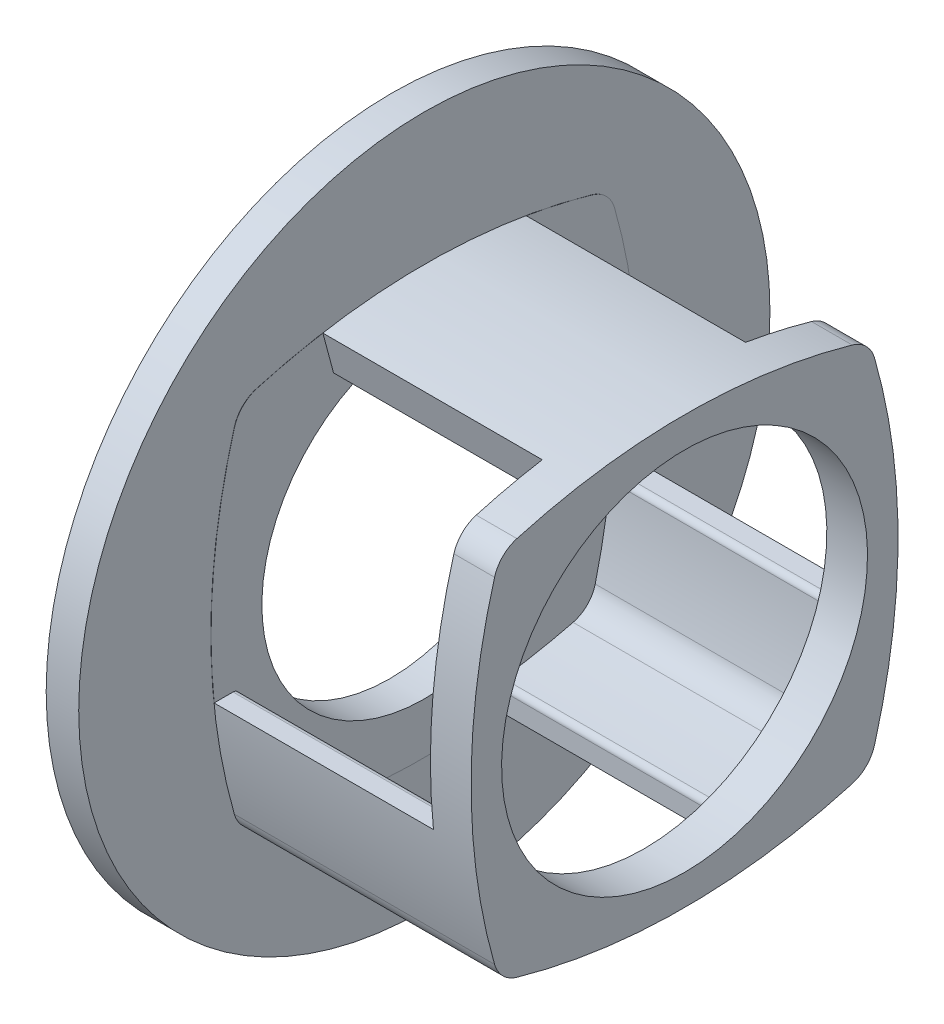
ISO-10303-21;
HEADER;
FILE_DESCRIPTION(('STEP AP214'),'2;1');
FILE_NAME('part.step','',(''),(''),'','','');
FILE_SCHEMA(('AUTOMOTIVE_DESIGN { 1 0 10303 214 1 1 1 1 }'));
ENDSEC;
DATA;
#1=APPLICATION_CONTEXT('core data for automotive mechanical design processes');
#2=APPLICATION_PROTOCOL_DEFINITION('international standard','automotive_design',2000,#1);
#3=PRODUCT_CONTEXT('',#1,'mechanical');
#4=PRODUCT('Part','Part','',(#3));
#5=PRODUCT_RELATED_PRODUCT_CATEGORY('part','',(#4));
#6=PRODUCT_DEFINITION_FORMATION('','',#4);
#7=PRODUCT_DEFINITION_CONTEXT('part definition',#1,'design');
#8=PRODUCT_DEFINITION('design','',#6,#7);
#9=PRODUCT_DEFINITION_SHAPE('','',#8);
#10=(LENGTH_UNIT() NAMED_UNIT(*) SI_UNIT(.MILLI.,.METRE.));
#11=(NAMED_UNIT(*) PLANE_ANGLE_UNIT() SI_UNIT($,.RADIAN.));
#12=(NAMED_UNIT(*) SI_UNIT($,.STERADIAN.) SOLID_ANGLE_UNIT());
#13=UNCERTAINTY_MEASURE_WITH_UNIT(LENGTH_MEASURE(1.E-05),#10,'distance_accuracy_value','');
#14=(GEOMETRIC_REPRESENTATION_CONTEXT(3) GLOBAL_UNCERTAINTY_ASSIGNED_CONTEXT((#13)) GLOBAL_UNIT_ASSIGNED_CONTEXT((#10,
#11,#12)) REPRESENTATION_CONTEXT('',''));
#15=CARTESIAN_POINT('',(0.,0.,0.));
#16=DIRECTION('',(0.,0.,1.));
#17=DIRECTION('',(1.,0.,0.));
#18=AXIS2_PLACEMENT_3D('',#15,#16,#17);
#19=CARTESIAN_POINT('',(153.35,0.,0.));
#20=DIRECTION('',(-1.,0.,0.));
#21=DIRECTION('',(0.,-1.,0.));
#22=AXIS2_PLACEMENT_3D('',#19,#20,#21);
#23=CYLINDRICAL_SURFACE('',#22,90.);
#24=CARTESIAN_POINT('',(125.,0.,0.));
#25=DIRECTION('',(-1.,0.,0.));
#26=DIRECTION('',(0.,-1.,0.));
#27=AXIS2_PLACEMENT_3D('',#24,#25,#26);
#28=CIRCLE('',#27,90.);
#29=CARTESIAN_POINT('',(125.,-90.,0.));
#30=VERTEX_POINT('',#29);
#31=EDGE_CURVE('E507',#30,#30,#28,.T.);
#32=ORIENTED_EDGE('',*,*,#31,.T.);
#33=EDGE_LOOP('',(#32));
#34=FACE_BOUND('',#33,.T.);
#35=CARTESIAN_POINT('',(145.,0.,0.));
#36=DIRECTION('',(-1.,0.,0.));
#37=DIRECTION('',(0.,-1.,0.));
#38=AXIS2_PLACEMENT_3D('',#35,#36,#37);
#39=CIRCLE('',#38,90.);
#40=CARTESIAN_POINT('',(145.,-90.,0.));
#41=VERTEX_POINT('',#40);
#42=EDGE_CURVE('E519',#41,#41,#39,.T.);
#43=ORIENTED_EDGE('',*,*,#42,.F.);
#44=EDGE_LOOP('',(#43));
#45=FACE_BOUND('',#44,.T.);
#46=ADVANCED_FACE('F17',(#34,#45),#23,.F.);
#47=CARTESIAN_POINT('',(17.,78.0612428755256,-78.0612428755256));
#48=DIRECTION('',(1.,0.,0.));
#49=DIRECTION('',(0.,0.,-1.));
#50=AXIS2_PLACEMENT_3D('',#47,#48,#49);
#51=CYLINDRICAL_SURFACE('',#50,16.0000000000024);
#52=DIRECTION('',(1.,0.,0.));
#53=VECTOR('',#52,1.);
#54=CARTESIAN_POINT('',(17.,82.4590593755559,-93.4449748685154));
#55=LINE('',#54,#53);
#56=CARTESIAN_POINT('',(125.,82.4590593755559,-93.4449748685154));
#57=VERTEX_POINT('',#56);
#58=CARTESIAN_POINT('',(145.,82.4590593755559,-93.4449748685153));
#59=VERTEX_POINT('',#58);
#60=EDGE_CURVE('E333',#57,#59,#55,.T.);
#61=ORIENTED_EDGE('',*,*,#60,.F.);
#62=CARTESIAN_POINT('',(125.,78.0612428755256,-78.0612428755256));
#63=DIRECTION('',(1.,0.,0.));
#64=DIRECTION('',(0.,0.,-1.));
#65=AXIS2_PLACEMENT_3D('',#62,#63,#64);
#66=CIRCLE('',#65,16.0000000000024);
#67=CARTESIAN_POINT('',(125.,93.4449748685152,-82.4590593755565));
#68=VERTEX_POINT('',#67);
#69=EDGE_CURVE('E512',#57,#68,#66,.T.);
#70=ORIENTED_EDGE('',*,*,#69,.T.);
#71=DIRECTION('',(1.,0.,0.));
#72=VECTOR('',#71,1.);
#73=CARTESIAN_POINT('',(17.,93.444974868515,-82.459059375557));
#74=LINE('',#73,#72);
#75=CARTESIAN_POINT('',(145.,93.4449748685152,-82.4590593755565));
#76=VERTEX_POINT('',#75);
#77=EDGE_CURVE('E309',#76,#68,#74,.F.);
#78=ORIENTED_EDGE('',*,*,#77,.F.);
#79=CARTESIAN_POINT('',(145.,78.0612428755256,-78.0612428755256));
#80=DIRECTION('',(1.,0.,0.));
#81=DIRECTION('',(0.,0.,-1.));
#82=AXIS2_PLACEMENT_3D('',#79,#80,#81);
#83=CIRCLE('',#82,16.0000000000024);
#84=EDGE_CURVE('E269',#59,#76,#83,.T.);
#85=ORIENTED_EDGE('',*,*,#84,.F.);
#86=EDGE_LOOP('',(#61,#70,#78,#85));
#87=FACE_BOUND('',#86,.T.);
#88=ADVANCED_FACE('F527',(#87),#51,.T.);
#89=CARTESIAN_POINT('',(17.,78.0612428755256,78.0612428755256));
#90=DIRECTION('',(1.,0.,0.));
#91=DIRECTION('',(0.,0.,-1.));
#92=AXIS2_PLACEMENT_3D('',#89,#90,#91);
#93=CYLINDRICAL_SURFACE('',#92,16.0000000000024);
#94=DIRECTION('',(1.,0.,0.));
#95=VECTOR('',#94,1.);
#96=CARTESIAN_POINT('',(17.,93.4449748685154,82.4590593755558));
#97=LINE('',#96,#95);
#98=CARTESIAN_POINT('',(125.,93.4449748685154,82.4590593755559));
#99=VERTEX_POINT('',#98);
#100=CARTESIAN_POINT('',(145.,93.4449748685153,82.4590593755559));
#101=VERTEX_POINT('',#100);
#102=EDGE_CURVE('E314',#99,#101,#97,.T.);
#103=ORIENTED_EDGE('',*,*,#102,.F.);
#104=CARTESIAN_POINT('',(125.,78.0612428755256,78.0612428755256));
#105=DIRECTION('',(1.,0.,0.));
#106=DIRECTION('',(0.,0.,-1.));
#107=AXIS2_PLACEMENT_3D('',#104,#105,#106);
#108=CIRCLE('',#107,16.0000000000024);
#109=CARTESIAN_POINT('',(125.,82.4590593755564,93.4449748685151));
#110=VERTEX_POINT('',#109);
#111=EDGE_CURVE('E510',#99,#110,#108,.T.);
#112=ORIENTED_EDGE('',*,*,#111,.T.);
#113=DIRECTION('',(1.,0.,0.));
#114=VECTOR('',#113,1.);
#115=CARTESIAN_POINT('',(17.,82.459059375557,93.444974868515));
#116=LINE('',#115,#114);
#117=CARTESIAN_POINT('',(145.,82.4590593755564,93.4449748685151));
#118=VERTEX_POINT('',#117);
#119=EDGE_CURVE('E296',#118,#110,#116,.F.);
#120=ORIENTED_EDGE('',*,*,#119,.F.);
#121=CARTESIAN_POINT('',(145.,78.0612428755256,78.0612428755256));
#122=DIRECTION('',(1.,0.,0.));
#123=DIRECTION('',(0.,0.,-1.));
#124=AXIS2_PLACEMENT_3D('',#121,#122,#123);
#125=CIRCLE('',#124,16.0000000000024);
#126=EDGE_CURVE('E522',#101,#118,#125,.T.);
#127=ORIENTED_EDGE('',*,*,#126,.F.);
#128=EDGE_LOOP('',(#103,#112,#120,#127));
#129=FACE_BOUND('',#128,.T.);
#130=ADVANCED_FACE('F535',(#129),#93,.T.);
#131=CARTESIAN_POINT('',(17.,-78.0612428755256,-78.0612428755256));
#132=DIRECTION('',(1.,0.,0.));
#133=DIRECTION('',(0.,0.,-1.));
#134=AXIS2_PLACEMENT_3D('',#131,#132,#133);
#135=CYLINDRICAL_SURFACE('',#134,16.0000000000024);
#136=DIRECTION('',(1.,0.,0.));
#137=VECTOR('',#136,1.);
#138=CARTESIAN_POINT('',(17.,-93.4449748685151,-82.4590593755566));
#139=LINE('',#138,#137);
#140=CARTESIAN_POINT('',(17.,-93.4449748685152,-82.4590593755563));
#141=VERTEX_POINT('',#140);
#142=CARTESIAN_POINT('',(145.,-93.4449748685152,-82.4590593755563));
#143=VERTEX_POINT('',#142);
#144=EDGE_CURVE('E262',#141,#143,#139,.T.);
#145=ORIENTED_EDGE('',*,*,#144,.F.);
#146=CARTESIAN_POINT('',(17.,-78.0612428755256,-78.0612428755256));
#147=DIRECTION('',(1.,0.,0.));
#148=DIRECTION('',(0.,0.,-1.));
#149=AXIS2_PLACEMENT_3D('',#146,#147,#148);
#150=CIRCLE('',#149,16.0000000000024);
#151=CARTESIAN_POINT('',(17.,-82.4590593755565,-93.4449748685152));
#152=VERTEX_POINT('',#151);
#153=EDGE_CURVE('E516',#141,#152,#150,.T.);
#154=ORIENTED_EDGE('',*,*,#153,.T.);
#155=DIRECTION('',(1.,0.,0.));
#156=VECTOR('',#155,1.);
#157=CARTESIAN_POINT('',(17.,-82.459059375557,-93.444974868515));
#158=LINE('',#157,#156);
#159=CARTESIAN_POINT('',(145.,-82.4590593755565,-93.4449748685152));
#160=VERTEX_POINT('',#159);
#161=EDGE_CURVE('E265',#160,#152,#158,.F.);
#162=ORIENTED_EDGE('',*,*,#161,.F.);
#163=CARTESIAN_POINT('',(145.,-78.0612428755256,-78.0612428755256));
#164=DIRECTION('',(1.,0.,0.));
#165=DIRECTION('',(0.,0.,-1.));
#166=AXIS2_PLACEMENT_3D('',#163,#164,#165);
#167=CIRCLE('',#166,16.0000000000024);
#168=EDGE_CURVE('E20',#143,#160,#167,.T.);
#169=ORIENTED_EDGE('',*,*,#168,.F.);
#170=EDGE_LOOP('',(#145,#154,#162,#169));
#171=FACE_BOUND('',#170,.T.);
#172=ADVANCED_FACE('F260',(#171),#135,.T.);
#173=CARTESIAN_POINT('',(145.,0.,0.));
#174=DIRECTION('',(1.,0.,0.));
#175=DIRECTION('',(0.,0.,-1.));
#176=AXIS2_PLACEMENT_3D('',#173,#174,#175);
#177=PLANE('',#176);
#178=ORIENTED_EDGE('',*,*,#42,.T.);
#179=EDGE_LOOP('',(#178));
#180=FACE_BOUND('',#179,.T.);
#181=CARTESIAN_POINT('',(145.,-78.0612428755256,78.0612428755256));
#182=DIRECTION('',(1.,0.,0.));
#183=DIRECTION('',(0.,0.,-1.));
#184=AXIS2_PLACEMENT_3D('',#181,#182,#183);
#185=CIRCLE('',#184,16.0000000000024);
#186=CARTESIAN_POINT('',(145.,-93.4449748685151,82.4590593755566));
#187=VERTEX_POINT('',#186);
#188=CARTESIAN_POINT('',(145.,-82.4590593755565,93.4449748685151));
#189=VERTEX_POINT('',#188);
#190=EDGE_CURVE('E274',#187,#189,#185,.F.);
#191=ORIENTED_EDGE('',*,*,#190,.F.);
#192=CARTESIAN_POINT('',(145.,194.999999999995,0.));
#193=DIRECTION('',(1.,0.,0.));
#194=DIRECTION('',(0.,0.,-1.));
#195=AXIS2_PLACEMENT_3D('',#192,#193,#194);
#196=CIRCLE('',#195,299.999999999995);
#197=EDGE_CURVE('E271',#143,#187,#196,.F.);
#198=ORIENTED_EDGE('',*,*,#197,.F.);
#199=ORIENTED_EDGE('',*,*,#168,.T.);
#200=CARTESIAN_POINT('',(145.,0.,194.999999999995));
#201=DIRECTION('',(1.,0.,0.));
#202=DIRECTION('',(0.,0.,-1.));
#203=AXIS2_PLACEMENT_3D('',#200,#201,#202);
#204=CIRCLE('',#203,299.999999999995);
#205=EDGE_CURVE('E332',#59,#160,#204,.F.);
#206=ORIENTED_EDGE('',*,*,#205,.F.);
#207=ORIENTED_EDGE('',*,*,#84,.T.);
#208=CARTESIAN_POINT('',(145.,-194.999999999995,0.));
#209=DIRECTION('',(1.,0.,0.));
#210=DIRECTION('',(0.,0.,-1.));
#211=AXIS2_PLACEMENT_3D('',#208,#209,#210);
#212=CIRCLE('',#211,299.999999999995);
#213=EDGE_CURVE('E313',#101,#76,#212,.F.);
#214=ORIENTED_EDGE('',*,*,#213,.F.);
#215=ORIENTED_EDGE('',*,*,#126,.T.);
#216=CARTESIAN_POINT('',(145.,0.,-194.999999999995));
#217=DIRECTION('',(1.,0.,0.));
#218=DIRECTION('',(0.,0.,-1.));
#219=AXIS2_PLACEMENT_3D('',#216,#217,#218);
#220=CIRCLE('',#219,299.999999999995);
#221=EDGE_CURVE('E300',#189,#118,#220,.F.);
#222=ORIENTED_EDGE('',*,*,#221,.F.);
#223=EDGE_LOOP('',(#191,#198,#199,#206,#207,#214,#215,#222));
#224=FACE_BOUND('',#223,.T.);
#225=ADVANCED_FACE('F272',(#180,#224),#177,.T.);
#226=CARTESIAN_POINT('',(17.,-78.0612428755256,78.0612428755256));
#227=DIRECTION('',(1.,0.,0.));
#228=DIRECTION('',(0.,0.,-1.));
#229=AXIS2_PLACEMENT_3D('',#226,#227,#228);
#230=CYLINDRICAL_SURFACE('',#229,16.0000000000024);
#231=DIRECTION('',(1.,0.,0.));
#232=VECTOR('',#231,1.);
#233=CARTESIAN_POINT('',(17.,-82.459059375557,93.444974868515));
#234=LINE('',#233,#232);
#235=CARTESIAN_POINT('',(17.,-82.4590593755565,93.4449748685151));
#236=VERTEX_POINT('',#235);
#237=EDGE_CURVE('E301',#236,#189,#234,.T.);
#238=ORIENTED_EDGE('',*,*,#237,.F.);
#239=CARTESIAN_POINT('',(17.,-78.0612428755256,78.0612428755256));
#240=DIRECTION('',(1.,0.,0.));
#241=DIRECTION('',(0.,0.,-1.));
#242=AXIS2_PLACEMENT_3D('',#239,#240,#241);
#243=CIRCLE('',#242,16.0000000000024);
#244=CARTESIAN_POINT('',(17.,-93.4449748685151,82.4590593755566));
#245=VERTEX_POINT('',#244);
#246=EDGE_CURVE('E514',#236,#245,#243,.T.);
#247=ORIENTED_EDGE('',*,*,#246,.T.);
#248=DIRECTION('',(1.,0.,0.));
#249=VECTOR('',#248,1.);
#250=CARTESIAN_POINT('',(17.,-93.4449748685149,82.4590593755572));
#251=LINE('',#250,#249);
#252=EDGE_CURVE('E278',#187,#245,#251,.F.);
#253=ORIENTED_EDGE('',*,*,#252,.F.);
#254=ORIENTED_EDGE('',*,*,#190,.T.);
#255=EDGE_LOOP('',(#238,#247,#253,#254));
#256=FACE_BOUND('',#255,.T.);
#257=ADVANCED_FACE('F544',(#256),#230,.T.);
#258=CARTESIAN_POINT('',(17.,0.,0.));
#259=DIRECTION('',(-1.,0.,0.));
#260=DIRECTION('',(0.,-1.,0.));
#261=AXIS2_PLACEMENT_3D('',#258,#259,#260);
#262=PLANE('',#261);
#263=CARTESIAN_POINT('',(17.,0.,-194.999999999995));
#264=DIRECTION('',(1.,0.,0.));
#265=DIRECTION('',(0.,0.,-1.));
#266=AXIS2_PLACEMENT_3D('',#263,#264,#265);
#267=CIRCLE('',#266,299.999999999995);
#268=CARTESIAN_POINT('',(17.,82.459059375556,93.4449748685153));
#269=VERTEX_POINT('',#268);
#270=EDGE_CURVE('E304',#269,#236,#267,.T.);
#271=ORIENTED_EDGE('',*,*,#270,.F.);
#272=CARTESIAN_POINT('',(17.,78.0612428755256,78.0612428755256));
#273=DIRECTION('',(1.,0.,0.));
#274=DIRECTION('',(0.,0.,-1.));
#275=AXIS2_PLACEMENT_3D('',#272,#273,#274);
#276=CIRCLE('',#275,16.0000000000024);
#277=CARTESIAN_POINT('',(17.,93.4449748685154,82.4590593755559));
#278=VERTEX_POINT('',#277);
#279=EDGE_CURVE('E453',#278,#269,#276,.T.);
#280=ORIENTED_EDGE('',*,*,#279,.F.);
#281=CARTESIAN_POINT('',(17.,-194.999999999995,0.));
#282=DIRECTION('',(1.,0.,0.));
#283=DIRECTION('',(0.,0.,-1.));
#284=AXIS2_PLACEMENT_3D('',#281,#282,#283);
#285=CIRCLE('',#284,299.999999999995);
#286=CARTESIAN_POINT('',(17.,93.4449748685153,-82.459059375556));
#287=VERTEX_POINT('',#286);
#288=EDGE_CURVE('E464',#287,#278,#285,.T.);
#289=ORIENTED_EDGE('',*,*,#288,.F.);
#290=CARTESIAN_POINT('',(17.,78.0612428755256,-78.0612428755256));
#291=DIRECTION('',(1.,0.,0.));
#292=DIRECTION('',(0.,0.,-1.));
#293=AXIS2_PLACEMENT_3D('',#290,#291,#292);
#294=CIRCLE('',#293,16.0000000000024);
#295=CARTESIAN_POINT('',(17.,82.4590593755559,-93.4449748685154));
#296=VERTEX_POINT('',#295);
#297=EDGE_CURVE('E308',#296,#287,#294,.T.);
#298=ORIENTED_EDGE('',*,*,#297,.F.);
#299=CARTESIAN_POINT('',(17.,0.,194.999999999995));
#300=DIRECTION('',(1.,0.,0.));
#301=DIRECTION('',(0.,0.,-1.));
#302=AXIS2_PLACEMENT_3D('',#299,#300,#301);
#303=CIRCLE('',#302,299.999999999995);
#304=EDGE_CURVE('E331',#152,#296,#303,.T.);
#305=ORIENTED_EDGE('',*,*,#304,.F.);
#306=ORIENTED_EDGE('',*,*,#153,.F.);
#307=CARTESIAN_POINT('',(17.,194.999999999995,0.));
#308=DIRECTION('',(1.,0.,0.));
#309=DIRECTION('',(0.,0.,-1.));
#310=AXIS2_PLACEMENT_3D('',#307,#308,#309);
#311=CIRCLE('',#310,299.999999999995);
#312=EDGE_CURVE('E283',#245,#141,#311,.T.);
#313=ORIENTED_EDGE('',*,*,#312,.F.);
#314=ORIENTED_EDGE('',*,*,#246,.F.);
#315=EDGE_LOOP('',(#271,#280,#289,#298,#305,#306,#313,#314));
#316=FACE_BOUND('',#315,.T.);
#317=CARTESIAN_POINT('',(17.,0.,0.));
#318=DIRECTION('',(-1.,0.,0.));
#319=DIRECTION('',(0.,-1.,0.));
#320=AXIS2_PLACEMENT_3D('',#317,#318,#319);
#321=CIRCLE('',#320,170.);
#322=CARTESIAN_POINT('',(17.,-170.,0.));
#323=VERTEX_POINT('',#322);
#324=EDGE_CURVE('E503',#323,#323,#321,.T.);
#325=ORIENTED_EDGE('',*,*,#324,.F.);
#326=EDGE_LOOP('',(#325));
#327=FACE_BOUND('',#326,.T.);
#328=ADVANCED_FACE('F546',(#316,#327),#262,.F.);
#329=CARTESIAN_POINT('',(125.,0.,0.));
#330=DIRECTION('',(1.,0.,0.));
#331=DIRECTION('',(0.,0.,-1.));
#332=AXIS2_PLACEMENT_3D('',#329,#330,#331);
#333=PLANE('',#332);
#334=ORIENTED_EDGE('',*,*,#31,.F.);
#335=EDGE_LOOP('',(#334));
#336=FACE_BOUND('',#335,.T.);
#337=CARTESIAN_POINT('',(125.,-93.4796166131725,38.9999999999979));
#338=DIRECTION('',(1.,0.,0.));
#339=DIRECTION('',(0.,0.,-1.));
#340=AXIS2_PLACEMENT_3D('',#337,#338,#339);
#341=CIRCLE('',#340,2.99999999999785);
#342=CARTESIAN_POINT('',(125.,-90.5045709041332,38.6138613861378));
#343=VERTEX_POINT('',#342);
#344=CARTESIAN_POINT('',(125.,-93.4796166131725,36.));
#345=VERTEX_POINT('',#344);
#346=EDGE_CURVE('E431',#343,#345,#341,.F.);
#347=ORIENTED_EDGE('',*,*,#346,.F.);
#348=CARTESIAN_POINT('',(125.,207.000000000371,-7.09624016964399E-11));
#349=DIRECTION('',(1.,0.,0.));
#350=DIRECTION('',(0.,0.,-1.));
#351=AXIS2_PLACEMENT_3D('',#348,#349,#350);
#352=CIRCLE('',#351,300.000000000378);
#353=CARTESIAN_POINT('',(125.,-83.9651447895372,73.0704079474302));
#354=VERTEX_POINT('',#353);
#355=EDGE_CURVE('E435',#343,#354,#352,.F.);
#356=ORIENTED_EDGE('',*,*,#355,.T.);
#357=CARTESIAN_POINT('',(125.,-69.4168875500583,69.4168875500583));
#358=DIRECTION('',(1.,0.,0.));
#359=DIRECTION('',(0.,0.,-1.));
#360=AXIS2_PLACEMENT_3D('',#357,#358,#359);
#361=CIRCLE('',#360,15.0000000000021);
#362=CARTESIAN_POINT('',(125.,-73.0704079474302,83.9651447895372));
#363=VERTEX_POINT('',#362);
#364=EDGE_CURVE('E439',#354,#363,#361,.F.);
#365=ORIENTED_EDGE('',*,*,#364,.T.);
#366=CARTESIAN_POINT('',(125.,2.90327761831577E-11,-207.000000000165));
#367=DIRECTION('',(1.,0.,0.));
#368=DIRECTION('',(0.,0.,-1.));
#369=AXIS2_PLACEMENT_3D('',#366,#367,#368);
#370=CIRCLE('',#369,300.000000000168);
#371=CARTESIAN_POINT('',(125.,-32.6732673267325,91.215455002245));
#372=VERTEX_POINT('',#371);
#373=EDGE_CURVE('E442',#363,#372,#370,.F.);
#374=ORIENTED_EDGE('',*,*,#373,.T.);
#375=CARTESIAN_POINT('',(125.,-32.9999999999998,94.1976095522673));
#376=DIRECTION('',(1.,0.,0.));
#377=DIRECTION('',(0.,0.,-1.));
#378=AXIS2_PLACEMENT_3D('',#375,#376,#377);
#379=CIRCLE('',#378,2.99999999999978);
#380=CARTESIAN_POINT('',(125.,-30.,94.1976095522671));
#381=VERTEX_POINT('',#380);
#382=EDGE_CURVE('E444',#381,#372,#379,.F.);
#383=ORIENTED_EDGE('',*,*,#382,.F.);
#384=DIRECTION('',(0.,0.,-1.));
#385=VECTOR('',#384,1.);
#386=CARTESIAN_POINT('',(125.,-29.9999999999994,108.49623113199));
#387=LINE('',#386,#385);
#388=CARTESIAN_POINT('',(125.,-29.9999999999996,103.496231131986));
#389=VERTEX_POINT('',#388);
#390=EDGE_CURVE('E291',#381,#389,#387,.F.);
#391=ORIENTED_EDGE('',*,*,#390,.T.);
#392=CARTESIAN_POINT('',(125.,0.,-194.999999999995));
#393=DIRECTION('',(1.,0.,0.));
#394=DIRECTION('',(0.,0.,-1.));
#395=AXIS2_PLACEMENT_3D('',#392,#393,#394);
#396=CIRCLE('',#395,299.999999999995);
#397=EDGE_CURVE('E299',#110,#389,#396,.T.);
#398=ORIENTED_EDGE('',*,*,#397,.F.);
#399=ORIENTED_EDGE('',*,*,#111,.F.);
#400=CARTESIAN_POINT('',(125.,-194.999999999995,0.));
#401=DIRECTION('',(1.,0.,0.));
#402=DIRECTION('',(0.,0.,-1.));
#403=AXIS2_PLACEMENT_3D('',#400,#401,#402);
#404=CIRCLE('',#403,299.999999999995);
#405=CARTESIAN_POINT('',(125.,100.80398915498,50.000000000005));
#406=VERTEX_POINT('',#405);
#407=EDGE_CURVE('E317',#406,#99,#404,.T.);
#408=ORIENTED_EDGE('',*,*,#407,.F.);
#409=DIRECTION('',(0.,0.965925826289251,0.258819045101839));
#410=VECTOR('',#409,1.);
#411=CARTESIAN_POINT('',(125.,81.2423421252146,44.7584724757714));
#412=LINE('',#411,#410);
#413=CARTESIAN_POINT('',(125.,81.2423421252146,44.7584724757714));
#414=VERTEX_POINT('',#413);
#415=EDGE_CURVE('E318',#406,#414,#412,.F.);
#416=ORIENTED_EDGE('',*,*,#415,.T.);
#417=CARTESIAN_POINT('',(125.,-215.399999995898,-5.741758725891E-10));
#418=DIRECTION('',(1.,0.,0.));
#419=DIRECTION('',(0.,0.,-1.));
#420=AXIS2_PLACEMENT_3D('',#417,#418,#419);
#421=CIRCLE('',#420,299.999999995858);
#422=CARTESIAN_POINT('',(125.,82.3399409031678,36.7549668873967));
#423=VERTEX_POINT('',#422);
#424=EDGE_CURVE('E467',#414,#423,#421,.F.);
#425=ORIENTED_EDGE('',*,*,#424,.T.);
#426=CARTESIAN_POINT('',(125.,84.3248738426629,37.0000000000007));
#427=DIRECTION('',(1.,0.,0.));
#428=DIRECTION('',(0.,0.,-1.));
#429=AXIS2_PLACEMENT_3D('',#426,#427,#428);
#430=CIRCLE('',#429,2.00000000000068);
#431=CARTESIAN_POINT('',(125.,84.3248738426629,35.));
#432=VERTEX_POINT('',#431);
#433=EDGE_CURVE('E469',#432,#423,#430,.F.);
#434=ORIENTED_EDGE('',*,*,#433,.F.);
#435=DIRECTION('',(0.,-1.,0.));
#436=VECTOR('',#435,1.);
#437=CARTESIAN_POINT('',(125.,90.951338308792,35.));
#438=LINE('',#437,#436);
#439=CARTESIAN_POINT('',(125.,90.951338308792,35.));
#440=VERTEX_POINT('',#439);
#441=EDGE_CURVE('E322',#432,#440,#438,.F.);
#442=ORIENTED_EDGE('',*,*,#441,.T.);
#443=CARTESIAN_POINT('',(125.,-207.000000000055,0.));
#444=DIRECTION('',(1.,0.,0.));
#445=DIRECTION('',(0.,0.,-1.));
#446=AXIS2_PLACEMENT_3D('',#443,#444,#445);
#447=CIRCLE('',#446,300.000000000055);
#448=CARTESIAN_POINT('',(125.,90.951338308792,-35.));
#449=VERTEX_POINT('',#448);
#450=EDGE_CURVE('E473',#440,#449,#447,.F.);
#451=ORIENTED_EDGE('',*,*,#450,.T.);
#452=DIRECTION('',(0.,1.,0.));
#453=VECTOR('',#452,1.);
#454=CARTESIAN_POINT('',(125.,84.324873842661,-35.));
#455=LINE('',#454,#453);
#456=CARTESIAN_POINT('',(125.,84.324873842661,-35.));
#457=VERTEX_POINT('',#456);
#458=EDGE_CURVE('E326',#449,#457,#455,.F.);
#459=ORIENTED_EDGE('',*,*,#458,.T.);
#460=CARTESIAN_POINT('',(125.,84.324873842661,-36.9999999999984));
#461=DIRECTION('',(1.,0.,0.));
#462=DIRECTION('',(0.,0.,-1.));
#463=AXIS2_PLACEMENT_3D('',#460,#461,#462);
#464=CIRCLE('',#463,1.99999999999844);
#465=CARTESIAN_POINT('',(125.,82.3399409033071,-36.7549668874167));
#466=VERTEX_POINT('',#465);
#467=EDGE_CURVE('E329',#466,#457,#464,.F.);
#468=ORIENTED_EDGE('',*,*,#467,.F.);
#469=CARTESIAN_POINT('',(125.,-215.399999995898,-5.741758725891E-10));
#470=DIRECTION('',(1.,0.,0.));
#471=DIRECTION('',(0.,0.,-1.));
#472=AXIS2_PLACEMENT_3D('',#469,#470,#471);
#473=CIRCLE('',#472,299.999999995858);
#474=CARTESIAN_POINT('',(125.,81.242342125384,-44.758472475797));
#475=VERTEX_POINT('',#474);
#476=EDGE_CURVE('E307',#466,#475,#473,.F.);
#477=ORIENTED_EDGE('',*,*,#476,.T.);
#478=DIRECTION('',(0.,-0.965925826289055,0.258819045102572));
#479=VECTOR('',#478,1.);
#480=CARTESIAN_POINT('',(125.,105.58461180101,-51.280963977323));
#481=LINE('',#480,#479);
#482=CARTESIAN_POINT('',(125.,100.803989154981,-50.0000000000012));
#483=VERTEX_POINT('',#482);
#484=EDGE_CURVE('E305',#475,#483,#481,.F.);
#485=ORIENTED_EDGE('',*,*,#484,.T.);
#486=CARTESIAN_POINT('',(125.,-194.999999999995,0.));
#487=DIRECTION('',(1.,0.,0.));
#488=DIRECTION('',(0.,0.,-1.));
#489=AXIS2_PLACEMENT_3D('',#486,#487,#488);
#490=CIRCLE('',#489,299.999999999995);
#491=EDGE_CURVE('E312',#68,#483,#490,.T.);
#492=ORIENTED_EDGE('',*,*,#491,.F.);
#493=ORIENTED_EDGE('',*,*,#69,.F.);
#494=CARTESIAN_POINT('',(125.,0.,194.999999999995));
#495=DIRECTION('',(1.,0.,0.));
#496=DIRECTION('',(0.,0.,-1.));
#497=AXIS2_PLACEMENT_3D('',#494,#495,#496);
#498=CIRCLE('',#497,299.999999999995);
#499=CARTESIAN_POINT('',(125.,-30.0000000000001,-103.496231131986));
#500=VERTEX_POINT('',#499);
#501=EDGE_CURVE('E336',#500,#57,#498,.T.);
#502=ORIENTED_EDGE('',*,*,#501,.F.);
#503=DIRECTION('',(0.,0.,-1.));
#504=VECTOR('',#503,1.);
#505=CARTESIAN_POINT('',(125.,-30.,-94.1976095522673));
#506=LINE('',#505,#504);
#507=CARTESIAN_POINT('',(125.,-30.,-94.1976095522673));
#508=VERTEX_POINT('',#507);
#509=EDGE_CURVE('E337',#500,#508,#506,.F.);
#510=ORIENTED_EDGE('',*,*,#509,.T.);
#511=CARTESIAN_POINT('',(125.,-32.9999999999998,-94.1976095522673));
#512=DIRECTION('',(1.,0.,0.));
#513=DIRECTION('',(0.,0.,-1.));
#514=AXIS2_PLACEMENT_3D('',#511,#512,#513);
#515=CIRCLE('',#514,2.99999999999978);
#516=CARTESIAN_POINT('',(125.,-32.6732673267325,-91.215455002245));
#517=VERTEX_POINT('',#516);
#518=EDGE_CURVE('E339',#517,#508,#515,.F.);
#519=ORIENTED_EDGE('',*,*,#518,.F.);
#520=CARTESIAN_POINT('',(125.,2.90327761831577E-11,207.000000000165));
#521=DIRECTION('',(1.,0.,0.));
#522=DIRECTION('',(0.,0.,-1.));
#523=AXIS2_PLACEMENT_3D('',#520,#521,#522);
#524=CIRCLE('',#523,300.000000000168);
#525=CARTESIAN_POINT('',(125.,-73.0704079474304,-83.9651447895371));
#526=VERTEX_POINT('',#525);
#527=EDGE_CURVE('E490',#517,#526,#524,.F.);
#528=ORIENTED_EDGE('',*,*,#527,.T.);
#529=CARTESIAN_POINT('',(125.,-69.4168875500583,-69.4168875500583));
#530=DIRECTION('',(1.,0.,0.));
#531=DIRECTION('',(0.,0.,-1.));
#532=AXIS2_PLACEMENT_3D('',#529,#530,#531);
#533=CIRCLE('',#532,15.0000000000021);
#534=CARTESIAN_POINT('',(125.,-83.9651447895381,-73.0704079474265));
#535=VERTEX_POINT('',#534);
#536=EDGE_CURVE('E494',#526,#535,#533,.F.);
#537=ORIENTED_EDGE('',*,*,#536,.T.);
#538=CARTESIAN_POINT('',(125.,207.000000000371,-7.09624016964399E-11));
#539=DIRECTION('',(1.,0.,0.));
#540=DIRECTION('',(0.,0.,-1.));
#541=AXIS2_PLACEMENT_3D('',#538,#539,#540);
#542=CIRCLE('',#541,300.000000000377);
#543=CARTESIAN_POINT('',(125.,-90.5045709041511,-38.6138613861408));
#544=VERTEX_POINT('',#543);
#545=EDGE_CURVE('E497',#535,#544,#542,.F.);
#546=ORIENTED_EDGE('',*,*,#545,.T.);
#547=CARTESIAN_POINT('',(125.,-93.4796166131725,-38.9999999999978));
#548=DIRECTION('',(1.,0.,0.));
#549=DIRECTION('',(0.,0.,-1.));
#550=AXIS2_PLACEMENT_3D('',#547,#548,#549);
#551=CIRCLE('',#550,2.99999999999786);
#552=CARTESIAN_POINT('',(125.,-93.4796166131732,-36.));
#553=VERTEX_POINT('',#552);
#554=EDGE_CURVE('E499',#553,#544,#551,.F.);
#555=ORIENTED_EDGE('',*,*,#554,.F.);
#556=DIRECTION('',(0.,1.,0.));
#557=VECTOR('',#556,1.);
#558=CARTESIAN_POINT('',(125.,-107.83216750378,-36.));
#559=LINE('',#558,#557);
#560=CARTESIAN_POINT('',(125.,-102.832167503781,-35.9999999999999));
#561=VERTEX_POINT('',#560);
#562=EDGE_CURVE('E506',#553,#561,#559,.F.);
#563=ORIENTED_EDGE('',*,*,#562,.T.);
#564=CARTESIAN_POINT('',(125.,194.999999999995,0.));
#565=DIRECTION('',(1.,0.,0.));
#566=DIRECTION('',(0.,0.,-1.));
#567=AXIS2_PLACEMENT_3D('',#564,#565,#566);
#568=CIRCLE('',#567,299.999999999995);
#569=CARTESIAN_POINT('',(125.,-102.83216750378,36.));
#570=VERTEX_POINT('',#569);
#571=EDGE_CURVE('E427',#570,#561,#568,.T.);
#572=ORIENTED_EDGE('',*,*,#571,.F.);
#573=DIRECTION('',(0.,1.,0.));
#574=VECTOR('',#573,1.);
#575=CARTESIAN_POINT('',(125.,-93.4796166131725,36.));
#576=LINE('',#575,#574);
#577=EDGE_CURVE('E286',#570,#345,#576,.T.);
#578=ORIENTED_EDGE('',*,*,#577,.T.);
#579=EDGE_LOOP('',(#347,#356,#365,#374,#383,#391,#398,#399,#408,#416,#425,#434,#442,#451,#459,
#468,#477,#485,#492,#493,#502,#510,#519,#528,#537,#546,#555,#563,#572,#578));
#580=FACE_BOUND('',#579,.T.);
#581=ADVANCED_FACE('F559',(#336,#580),#333,.F.);
#582=CARTESIAN_POINT('',(17.85,0.,0.));
#583=DIRECTION('',(-1.,0.,0.));
#584=DIRECTION('',(0.,-1.,0.));
#585=AXIS2_PLACEMENT_3D('',#582,#583,#584);
#586=CYLINDRICAL_SURFACE('',#585,170.);
#587=ORIENTED_EDGE('',*,*,#324,.T.);
#588=EDGE_LOOP('',(#587));
#589=FACE_BOUND('',#588,.T.);
#590=CARTESIAN_POINT('',(0.99999999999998,0.,0.));
#591=DIRECTION('',(-1.,0.,0.));
#592=DIRECTION('',(0.,-1.,0.));
#593=AXIS2_PLACEMENT_3D('',#590,#591,#592);
#594=CIRCLE('',#593,170.);
#595=CARTESIAN_POINT('',(0.999999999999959,-170.,0.));
#596=VERTEX_POINT('',#595);
#597=EDGE_CURVE('E423',#596,#596,#594,.T.);
#598=ORIENTED_EDGE('',*,*,#597,.F.);
#599=EDGE_LOOP('',(#598));
#600=FACE_BOUND('',#599,.T.);
#601=ADVANCED_FACE('F921',(#589,#600),#586,.T.);
#602=CARTESIAN_POINT('',(17.1,-107.83216750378,-36.));
#603=DIRECTION('',(0.,0.,-1.));
#604=DIRECTION('',(0.,1.,0.));
#605=AXIS2_PLACEMENT_3D('',#602,#603,#604);
#606=PLANE('',#605);
#607=DIRECTION('',(1.,0.,0.));
#608=VECTOR('',#607,1.);
#609=CARTESIAN_POINT('',(17.1,-93.479616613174,-36.));
#610=LINE('',#609,#608);
#611=CARTESIAN_POINT('',(17.1,-93.4796166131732,-36.));
#612=VERTEX_POINT('',#611);
#613=EDGE_CURVE('E502',#612,#553,#610,.T.);
#614=ORIENTED_EDGE('',*,*,#613,.F.);
#615=DIRECTION('',(0.,1.,0.));
#616=VECTOR('',#615,1.);
#617=CARTESIAN_POINT('',(17.1,0.,-36.));
#618=LINE('',#617,#616);
#619=CARTESIAN_POINT('',(17.1,-102.83216750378,-35.9999999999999));
#620=VERTEX_POINT('',#619);
#621=EDGE_CURVE('E422',#620,#612,#618,.T.);
#622=ORIENTED_EDGE('',*,*,#621,.F.);
#623=DIRECTION('',(1.,0.,0.));
#624=VECTOR('',#623,1.);
#625=CARTESIAN_POINT('',(17.,-102.83216750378,-35.9999999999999));
#626=LINE('',#625,#624);
#627=EDGE_CURVE('E426',#561,#620,#626,.F.);
#628=ORIENTED_EDGE('',*,*,#627,.F.);
#629=ORIENTED_EDGE('',*,*,#562,.F.);
#630=EDGE_LOOP('',(#614,#622,#628,#629));
#631=FACE_BOUND('',#630,.T.);
#632=ADVANCED_FACE('F659',(#631),#606,.F.);
#633=CARTESIAN_POINT('',(17.1,-93.4796166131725,-38.9999999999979));
#634=DIRECTION('',(1.,0.,0.));
#635=DIRECTION('',(0.,0.,-1.));
#636=AXIS2_PLACEMENT_3D('',#633,#634,#635);
#637=CYLINDRICAL_SURFACE('',#636,2.99999999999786);
#638=DIRECTION('',(1.,0.,0.));
#639=VECTOR('',#638,1.);
#640=CARTESIAN_POINT('',(17.1,-90.504570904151,-38.6138613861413));
#641=LINE('',#640,#639);
#642=CARTESIAN_POINT('',(17.1,-90.5045709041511,-38.6138613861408));
#643=VERTEX_POINT('',#642);
#644=EDGE_CURVE('E496',#544,#643,#641,.F.);
#645=ORIENTED_EDGE('',*,*,#644,.T.);
#646=CARTESIAN_POINT('',(17.1,-93.4796166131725,-38.9999999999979));
#647=DIRECTION('',(1.,0.,0.));
#648=DIRECTION('',(0.,0.,-1.));
#649=AXIS2_PLACEMENT_3D('',#646,#647,#648);
#650=CIRCLE('',#649,2.99999999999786);
#651=EDGE_CURVE('E419',#612,#643,#650,.F.);
#652=ORIENTED_EDGE('',*,*,#651,.F.);
#653=ORIENTED_EDGE('',*,*,#613,.T.);
#654=ORIENTED_EDGE('',*,*,#554,.T.);
#655=EDGE_LOOP('',(#645,#652,#653,#654));
#656=FACE_BOUND('',#655,.T.);
#657=ADVANCED_FACE('F662',(#656),#637,.T.);
#658=CARTESIAN_POINT('',(17.1,207.000000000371,-7.09690084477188E-11));
#659=DIRECTION('',(1.,0.,0.));
#660=DIRECTION('',(0.,0.,-1.));
#661=AXIS2_PLACEMENT_3D('',#658,#659,#660);
#662=CYLINDRICAL_SURFACE('',#661,300.000000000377);
#663=ORIENTED_EDGE('',*,*,#545,.F.);
#664=DIRECTION('',(1.,0.,0.));
#665=VECTOR('',#664,1.);
#666=CARTESIAN_POINT('',(17.1,-83.965144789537,-73.0704079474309));
#667=LINE('',#666,#665);
#668=CARTESIAN_POINT('',(17.1,-83.9651447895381,-73.0704079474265));
#669=VERTEX_POINT('',#668);
#670=EDGE_CURVE('E493',#535,#669,#667,.F.);
#671=ORIENTED_EDGE('',*,*,#670,.T.);
#672=CARTESIAN_POINT('',(17.1,207.000000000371,-7.09690084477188E-11));
#673=DIRECTION('',(1.,0.,0.));
#674=DIRECTION('',(0.,0.,-1.));
#675=AXIS2_PLACEMENT_3D('',#672,#673,#674);
#676=CIRCLE('',#675,300.000000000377);
#677=EDGE_CURVE('E416',#643,#669,#676,.T.);
#678=ORIENTED_EDGE('',*,*,#677,.F.);
#679=ORIENTED_EDGE('',*,*,#644,.F.);
#680=EDGE_LOOP('',(#663,#671,#678,#679));
#681=FACE_BOUND('',#680,.T.);
#682=ADVANCED_FACE('F667',(#681),#662,.F.);
#683=CARTESIAN_POINT('',(17.1,-69.4168875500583,-69.4168875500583));
#684=DIRECTION('',(1.,0.,0.));
#685=DIRECTION('',(0.,0.,-1.));
#686=AXIS2_PLACEMENT_3D('',#683,#684,#685);
#687=CYLINDRICAL_SURFACE('',#686,15.0000000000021);
#688=ORIENTED_EDGE('',*,*,#536,.F.);
#689=DIRECTION('',(1.,0.,0.));
#690=VECTOR('',#689,1.);
#691=CARTESIAN_POINT('',(17.1,-73.070407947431,-83.965144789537));
#692=LINE('',#691,#690);
#693=CARTESIAN_POINT('',(17.1,-73.0704079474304,-83.9651447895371));
#694=VERTEX_POINT('',#693);
#695=EDGE_CURVE('E492',#526,#694,#692,.F.);
#696=ORIENTED_EDGE('',*,*,#695,.T.);
#697=CARTESIAN_POINT('',(17.1,-69.4168875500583,-69.4168875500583));
#698=DIRECTION('',(1.,0.,0.));
#699=DIRECTION('',(0.,0.,-1.));
#700=AXIS2_PLACEMENT_3D('',#697,#698,#699);
#701=CIRCLE('',#700,15.0000000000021);
#702=EDGE_CURVE('E413',#669,#694,#701,.T.);
#703=ORIENTED_EDGE('',*,*,#702,.F.);
#704=ORIENTED_EDGE('',*,*,#670,.F.);
#705=EDGE_LOOP('',(#688,#696,#703,#704));
#706=FACE_BOUND('',#705,.T.);
#707=ADVANCED_FACE('F673',(#706),#687,.F.);
#708=CARTESIAN_POINT('',(17.1,2.90327761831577E-11,207.000000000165));
#709=DIRECTION('',(1.,0.,0.));
#710=DIRECTION('',(0.,0.,-1.));
#711=AXIS2_PLACEMENT_3D('',#708,#709,#710);
#712=CYLINDRICAL_SURFACE('',#711,300.000000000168);
#713=ORIENTED_EDGE('',*,*,#527,.F.);
#714=DIRECTION('',(1.,0.,0.));
#715=VECTOR('',#714,1.);
#716=CARTESIAN_POINT('',(17.1,-32.6732673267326,-91.215455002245));
#717=LINE('',#716,#715);
#718=CARTESIAN_POINT('',(17.1,-32.6732673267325,-91.215455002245));
#719=VERTEX_POINT('',#718);
#720=EDGE_CURVE('E489',#719,#517,#717,.T.);
#721=ORIENTED_EDGE('',*,*,#720,.F.);
#722=CARTESIAN_POINT('',(17.1,2.90327761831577E-11,207.000000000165));
#723=DIRECTION('',(1.,0.,0.));
#724=DIRECTION('',(0.,0.,-1.));
#725=AXIS2_PLACEMENT_3D('',#722,#723,#724);
#726=CIRCLE('',#725,300.000000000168);
#727=EDGE_CURVE('E410',#694,#719,#726,.T.);
#728=ORIENTED_EDGE('',*,*,#727,.F.);
#729=ORIENTED_EDGE('',*,*,#695,.F.);
#730=EDGE_LOOP('',(#713,#721,#728,#729));
#731=FACE_BOUND('',#730,.T.);
#732=ADVANCED_FACE('F676',(#731),#712,.F.);
#733=CARTESIAN_POINT('',(17.1,-32.9999999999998,-94.1976095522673));
#734=DIRECTION('',(1.,0.,0.));
#735=DIRECTION('',(0.,0.,-1.));
#736=AXIS2_PLACEMENT_3D('',#733,#734,#735);
#737=CYLINDRICAL_SURFACE('',#736,2.99999999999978);
#738=DIRECTION('',(1.,0.,0.));
#739=VECTOR('',#738,1.);
#740=CARTESIAN_POINT('',(17.1,-30.,-94.1976095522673));
#741=LINE('',#740,#739);
#742=CARTESIAN_POINT('',(17.1,-30.,-94.1976095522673));
#743=VERTEX_POINT('',#742);
#744=EDGE_CURVE('E338',#508,#743,#741,.F.);
#745=ORIENTED_EDGE('',*,*,#744,.T.);
#746=CARTESIAN_POINT('',(17.1,-32.9999999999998,-94.1976095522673));
#747=DIRECTION('',(1.,0.,0.));
#748=DIRECTION('',(0.,0.,-1.));
#749=AXIS2_PLACEMENT_3D('',#746,#747,#748);
#750=CIRCLE('',#749,2.99999999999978);
#751=EDGE_CURVE('E407',#719,#743,#750,.F.);
#752=ORIENTED_EDGE('',*,*,#751,.F.);
#753=ORIENTED_EDGE('',*,*,#720,.T.);
#754=ORIENTED_EDGE('',*,*,#518,.T.);
#755=EDGE_LOOP('',(#745,#752,#753,#754));
#756=FACE_BOUND('',#755,.T.);
#757=ADVANCED_FACE('F679',(#756),#737,.T.);
#758=CARTESIAN_POINT('',(17.1,-30.,-94.1976095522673));
#759=DIRECTION('',(0.,-1.,0.));
#760=DIRECTION('',(0.,0.,-1.));
#761=AXIS2_PLACEMENT_3D('',#758,#759,#760);
#762=PLANE('',#761);
#763=ORIENTED_EDGE('',*,*,#744,.F.);
#764=ORIENTED_EDGE('',*,*,#509,.F.);
#765=DIRECTION('',(1.,0.,0.));
#766=VECTOR('',#765,1.);
#767=CARTESIAN_POINT('',(17.,-30.0000000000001,-103.496231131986));
#768=LINE('',#767,#766);
#769=CARTESIAN_POINT('',(17.1,-30.,-103.496231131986));
#770=VERTEX_POINT('',#769);
#771=EDGE_CURVE('E486',#770,#500,#768,.T.);
#772=ORIENTED_EDGE('',*,*,#771,.F.);
#773=DIRECTION('',(0.,0.,-1.));
#774=VECTOR('',#773,1.);
#775=CARTESIAN_POINT('',(17.1,-30.,0.));
#776=LINE('',#775,#774);
#777=EDGE_CURVE('E406',#743,#770,#776,.T.);
#778=ORIENTED_EDGE('',*,*,#777,.F.);
#779=EDGE_LOOP('',(#763,#764,#772,#778));
#780=FACE_BOUND('',#779,.T.);
#781=ADVANCED_FACE('F683',(#780),#762,.F.);
#782=CARTESIAN_POINT('',(17.,0.,194.999999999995));
#783=DIRECTION('',(1.,0.,0.));
#784=DIRECTION('',(0.,0.,-1.));
#785=AXIS2_PLACEMENT_3D('',#782,#783,#784);
#786=CYLINDRICAL_SURFACE('',#785,299.999999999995);
#787=DIRECTION('',(1.,0.,0.));
#788=VECTOR('',#787,1.);
#789=CARTESIAN_POINT('',(17.,82.4590593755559,-93.4449748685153));
#790=LINE('',#789,#788);
#791=CARTESIAN_POINT('',(17.1,82.4590593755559,-93.4449748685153));
#792=VERTEX_POINT('',#791);
#793=EDGE_CURVE('E481',#792,#296,#790,.F.);
#794=ORIENTED_EDGE('',*,*,#793,.F.);
#795=CARTESIAN_POINT('',(17.1,0.,194.999999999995));
#796=DIRECTION('',(1.,0.,0.));
#797=DIRECTION('',(0.,0.,-1.));
#798=AXIS2_PLACEMENT_3D('',#795,#796,#797);
#799=CIRCLE('',#798,299.999999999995);
#800=EDGE_CURVE('E403',#770,#792,#799,.T.);
#801=ORIENTED_EDGE('',*,*,#800,.F.);
#802=ORIENTED_EDGE('',*,*,#771,.T.);
#803=ORIENTED_EDGE('',*,*,#501,.T.);
#804=ORIENTED_EDGE('',*,*,#60,.T.);
#805=ORIENTED_EDGE('',*,*,#205,.T.);
#806=ORIENTED_EDGE('',*,*,#161,.T.);
#807=ORIENTED_EDGE('',*,*,#304,.T.);
#808=EDGE_LOOP('',(#794,#801,#802,#803,#804,#805,#806,#807));
#809=FACE_BOUND('',#808,.T.);
#810=ADVANCED_FACE('F553',(#809),#786,.T.);
#811=CARTESIAN_POINT('',(17.,78.0612428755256,-78.0612428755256));
#812=DIRECTION('',(1.,0.,0.));
#813=DIRECTION('',(0.,0.,-1.));
#814=AXIS2_PLACEMENT_3D('',#811,#812,#813);
#815=CYLINDRICAL_SURFACE('',#814,16.0000000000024);
#816=DIRECTION('',(1.,0.,0.));
#817=VECTOR('',#816,1.);
#818=CARTESIAN_POINT('',(17.,93.4449748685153,-82.459059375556));
#819=LINE('',#818,#817);
#820=CARTESIAN_POINT('',(17.1,93.4449748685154,-82.459059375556));
#821=VERTEX_POINT('',#820);
#822=EDGE_CURVE('E466',#821,#287,#819,.F.);
#823=ORIENTED_EDGE('',*,*,#822,.F.);
#824=CARTESIAN_POINT('',(17.1,78.0612428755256,-78.0612428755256));
#825=DIRECTION('',(1.,0.,0.));
#826=DIRECTION('',(0.,0.,-1.));
#827=AXIS2_PLACEMENT_3D('',#824,#825,#826);
#828=CIRCLE('',#827,16.0000000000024);
#829=EDGE_CURVE('E400',#792,#821,#828,.T.);
#830=ORIENTED_EDGE('',*,*,#829,.F.);
#831=ORIENTED_EDGE('',*,*,#793,.T.);
#832=ORIENTED_EDGE('',*,*,#297,.T.);
#833=EDGE_LOOP('',(#823,#830,#831,#832));
#834=FACE_BOUND('',#833,.T.);
#835=ADVANCED_FACE('F579',(#834),#815,.T.);
#836=CARTESIAN_POINT('',(17.1,105.58461180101,-51.280963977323));
#837=DIRECTION('',(0.,0.258819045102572,0.965925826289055));
#838=DIRECTION('',(0.,-0.965925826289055,0.258819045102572));
#839=AXIS2_PLACEMENT_3D('',#836,#837,#838);
#840=PLANE('',#839);
#841=DIRECTION('',(1.,0.,0.));
#842=VECTOR('',#841,1.);
#843=CARTESIAN_POINT('',(17.1,81.242342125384,-44.758472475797));
#844=LINE('',#843,#842);
#845=CARTESIAN_POINT('',(17.1,81.242342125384,-44.758472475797));
#846=VERTEX_POINT('',#845);
#847=EDGE_CURVE('E479',#475,#846,#844,.F.);
#848=ORIENTED_EDGE('',*,*,#847,.T.);
#849=DIRECTION('',(0.,-0.965925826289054,0.258819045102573));
#850=VECTOR('',#849,1.);
#851=CARTESIAN_POINT('',(17.1,100.803989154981,-50.0000000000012));
#852=LINE('',#851,#850);
#853=CARTESIAN_POINT('',(17.1,100.803989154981,-50.0000000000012));
#854=VERTEX_POINT('',#853);
#855=EDGE_CURVE('E396',#854,#846,#852,.T.);
#856=ORIENTED_EDGE('',*,*,#855,.F.);
#857=DIRECTION('',(1.,0.,0.));
#858=VECTOR('',#857,1.);
#859=CARTESIAN_POINT('',(17.,100.803989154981,-50.0000000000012));
#860=LINE('',#859,#858);
#861=EDGE_CURVE('E458',#483,#854,#860,.F.);
#862=ORIENTED_EDGE('',*,*,#861,.F.);
#863=ORIENTED_EDGE('',*,*,#484,.F.);
#864=EDGE_LOOP('',(#848,#856,#862,#863));
#865=FACE_BOUND('',#864,.T.);
#866=ADVANCED_FACE('F569',(#865),#840,.F.);
#867=CARTESIAN_POINT('',(17.1,-215.399999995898,-5.74182479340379E-10));
#868=DIRECTION('',(1.,0.,0.));
#869=DIRECTION('',(0.,0.,-1.));
#870=AXIS2_PLACEMENT_3D('',#867,#868,#869);
#871=CYLINDRICAL_SURFACE('',#870,299.999999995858);
#872=ORIENTED_EDGE('',*,*,#476,.F.);
#873=DIRECTION('',(1.,0.,0.));
#874=VECTOR('',#873,1.);
#875=CARTESIAN_POINT('',(17.1,82.339940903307,-36.754966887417));
#876=LINE('',#875,#874);
#877=CARTESIAN_POINT('',(17.1,82.339940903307,-36.7549668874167));
#878=VERTEX_POINT('',#877);
#879=EDGE_CURVE('E477',#878,#466,#876,.T.);
#880=ORIENTED_EDGE('',*,*,#879,.F.);
#881=CARTESIAN_POINT('',(17.1,-215.399999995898,-5.74182479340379E-10));
#882=DIRECTION('',(1.,0.,0.));
#883=DIRECTION('',(0.,0.,-1.));
#884=AXIS2_PLACEMENT_3D('',#881,#882,#883);
#885=CIRCLE('',#884,299.999999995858);
#886=EDGE_CURVE('E393',#846,#878,#885,.T.);
#887=ORIENTED_EDGE('',*,*,#886,.F.);
#888=ORIENTED_EDGE('',*,*,#847,.F.);
#889=EDGE_LOOP('',(#872,#880,#887,#888));
#890=FACE_BOUND('',#889,.T.);
#891=ADVANCED_FACE('F633',(#890),#871,.F.);
#892=CARTESIAN_POINT('',(17.1,84.324873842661,-36.9999999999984));
#893=DIRECTION('',(1.,0.,0.));
#894=DIRECTION('',(0.,0.,-1.));
#895=AXIS2_PLACEMENT_3D('',#892,#893,#894);
#896=CYLINDRICAL_SURFACE('',#895,1.99999999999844);
#897=DIRECTION('',(-1.,0.,0.));
#898=VECTOR('',#897,1.);
#899=CARTESIAN_POINT('',(17.1,84.324873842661,-35.));
#900=LINE('',#899,#898);
#901=CARTESIAN_POINT('',(17.1,84.324873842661,-35.));
#902=VERTEX_POINT('',#901);
#903=EDGE_CURVE('E328',#457,#902,#900,.T.);
#904=ORIENTED_EDGE('',*,*,#903,.T.);
#905=CARTESIAN_POINT('',(17.1,84.324873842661,-36.9999999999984));
#906=DIRECTION('',(1.,0.,0.));
#907=DIRECTION('',(0.,0.,-1.));
#908=AXIS2_PLACEMENT_3D('',#905,#906,#907);
#909=CIRCLE('',#908,1.99999999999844);
#910=EDGE_CURVE('E390',#878,#902,#909,.F.);
#911=ORIENTED_EDGE('',*,*,#910,.F.);
#912=ORIENTED_EDGE('',*,*,#879,.T.);
#913=ORIENTED_EDGE('',*,*,#467,.T.);
#914=EDGE_LOOP('',(#904,#911,#912,#913));
#915=FACE_BOUND('',#914,.T.);
#916=ADVANCED_FACE('F629',(#915),#896,.T.);
#917=CARTESIAN_POINT('',(17.1,84.324873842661,-35.));
#918=DIRECTION('',(0.,0.,-1.));
#919=DIRECTION('',(-1.,0.,0.));
#920=AXIS2_PLACEMENT_3D('',#917,#918,#919);
#921=PLANE('',#920);
#922=ORIENTED_EDGE('',*,*,#458,.F.);
#923=DIRECTION('',(1.,0.,0.));
#924=VECTOR('',#923,1.);
#925=CARTESIAN_POINT('',(17.1,90.951338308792,-35.));
#926=LINE('',#925,#924);
#927=CARTESIAN_POINT('',(17.1,90.951338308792,-35.));
#928=VERTEX_POINT('',#927);
#929=EDGE_CURVE('E325',#449,#928,#926,.F.);
#930=ORIENTED_EDGE('',*,*,#929,.T.);
#931=DIRECTION('',(0.,1.,0.));
#932=VECTOR('',#931,1.);
#933=CARTESIAN_POINT('',(17.1,0.,-35.));
#934=LINE('',#933,#932);
#935=EDGE_CURVE('E389',#902,#928,#934,.T.);
#936=ORIENTED_EDGE('',*,*,#935,.F.);
#937=ORIENTED_EDGE('',*,*,#903,.F.);
#938=EDGE_LOOP('',(#922,#930,#936,#937));
#939=FACE_BOUND('',#938,.T.);
#940=ADVANCED_FACE('F638',(#939),#921,.F.);
#941=CARTESIAN_POINT('',(17.1,-207.000000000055,0.));
#942=DIRECTION('',(1.,0.,0.));
#943=DIRECTION('',(0.,0.,-1.));
#944=AXIS2_PLACEMENT_3D('',#941,#942,#943);
#945=CYLINDRICAL_SURFACE('',#944,300.000000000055);
#946=ORIENTED_EDGE('',*,*,#450,.F.);
#947=DIRECTION('',(1.,0.,0.));
#948=VECTOR('',#947,1.);
#949=CARTESIAN_POINT('',(17.1,90.951338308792,35.));
#950=LINE('',#949,#948);
#951=CARTESIAN_POINT('',(17.1,90.951338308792,35.));
#952=VERTEX_POINT('',#951);
#953=EDGE_CURVE('E324',#440,#952,#950,.F.);
#954=ORIENTED_EDGE('',*,*,#953,.T.);
#955=CARTESIAN_POINT('',(17.1,-207.000000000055,0.));
#956=DIRECTION('',(1.,0.,0.));
#957=DIRECTION('',(0.,0.,-1.));
#958=AXIS2_PLACEMENT_3D('',#955,#956,#957);
#959=CIRCLE('',#958,300.000000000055);
#960=EDGE_CURVE('E386',#928,#952,#959,.T.);
#961=ORIENTED_EDGE('',*,*,#960,.F.);
#962=ORIENTED_EDGE('',*,*,#929,.F.);
#963=EDGE_LOOP('',(#946,#954,#961,#962));
#964=FACE_BOUND('',#963,.T.);
#965=ADVANCED_FACE('F642',(#964),#945,.F.);
#966=CARTESIAN_POINT('',(17.1,90.951338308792,35.));
#967=DIRECTION('',(0.,0.,1.));
#968=DIRECTION('',(0.,-1.,0.));
#969=AXIS2_PLACEMENT_3D('',#966,#967,#968);
#970=PLANE('',#969);
#971=ORIENTED_EDGE('',*,*,#441,.F.);
#972=DIRECTION('',(1.,0.,0.));
#973=VECTOR('',#972,1.);
#974=CARTESIAN_POINT('',(17.1,84.3248738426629,35.));
#975=LINE('',#974,#973);
#976=CARTESIAN_POINT('',(17.1,84.3248738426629,35.));
#977=VERTEX_POINT('',#976);
#978=EDGE_CURVE('E472',#977,#432,#975,.T.);
#979=ORIENTED_EDGE('',*,*,#978,.F.);
#980=DIRECTION('',(0.,1.,0.));
#981=VECTOR('',#980,1.);
#982=CARTESIAN_POINT('',(17.1,0.,35.));
#983=LINE('',#982,#981);
#984=EDGE_CURVE('E385',#952,#977,#983,.F.);
#985=ORIENTED_EDGE('',*,*,#984,.F.);
#986=ORIENTED_EDGE('',*,*,#953,.F.);
#987=EDGE_LOOP('',(#971,#979,#985,#986));
#988=FACE_BOUND('',#987,.T.);
#989=ADVANCED_FACE('F759',(#988),#970,.F.);
#990=CARTESIAN_POINT('',(17.1,84.3248738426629,37.0000000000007));
#991=DIRECTION('',(1.,0.,0.));
#992=DIRECTION('',(0.,0.,-1.));
#993=AXIS2_PLACEMENT_3D('',#990,#991,#992);
#994=CYLINDRICAL_SURFACE('',#993,2.00000000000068);
#995=DIRECTION('',(1.,0.,0.));
#996=VECTOR('',#995,1.);
#997=CARTESIAN_POINT('',(17.1,82.3399409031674,36.7549668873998));
#998=LINE('',#997,#996);
#999=CARTESIAN_POINT('',(17.1,82.3399409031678,36.7549668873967));
#1000=VERTEX_POINT('',#999);
#1001=EDGE_CURVE('E321',#423,#1000,#998,.F.);
#1002=ORIENTED_EDGE('',*,*,#1001,.T.);
#1003=CARTESIAN_POINT('',(17.1,84.3248738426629,37.0000000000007));
#1004=DIRECTION('',(1.,0.,0.));
#1005=DIRECTION('',(0.,0.,-1.));
#1006=AXIS2_PLACEMENT_3D('',#1003,#1004,#1005);
#1007=CIRCLE('',#1006,2.00000000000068);
#1008=EDGE_CURVE('E382',#977,#1000,#1007,.F.);
#1009=ORIENTED_EDGE('',*,*,#1008,.F.);
#1010=ORIENTED_EDGE('',*,*,#978,.T.);
#1011=ORIENTED_EDGE('',*,*,#433,.T.);
#1012=EDGE_LOOP('',(#1002,#1009,#1010,#1011));
#1013=FACE_BOUND('',#1012,.T.);
#1014=ADVANCED_FACE('F755',(#1013),#994,.T.);
#1015=CARTESIAN_POINT('',(17.1,-215.399999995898,-5.74182479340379E-10));
#1016=DIRECTION('',(1.,0.,0.));
#1017=DIRECTION('',(0.,0.,-1.));
#1018=AXIS2_PLACEMENT_3D('',#1015,#1016,#1017);
#1019=CYLINDRICAL_SURFACE('',#1018,299.999999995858);
#1020=ORIENTED_EDGE('',*,*,#424,.F.);
#1021=DIRECTION('',(1.,0.,0.));
#1022=VECTOR('',#1021,1.);
#1023=CARTESIAN_POINT('',(17.1,81.2423421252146,44.7584724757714));
#1024=LINE('',#1023,#1022);
#1025=CARTESIAN_POINT('',(17.1,81.2423421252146,44.7584724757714));
#1026=VERTEX_POINT('',#1025);
#1027=EDGE_CURVE('E320',#414,#1026,#1024,.F.);
#1028=ORIENTED_EDGE('',*,*,#1027,.T.);
#1029=CARTESIAN_POINT('',(17.1,-215.399999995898,-5.74182479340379E-10));
#1030=DIRECTION('',(1.,0.,0.));
#1031=DIRECTION('',(0.,0.,-1.));
#1032=AXIS2_PLACEMENT_3D('',#1029,#1030,#1031);
#1033=CIRCLE('',#1032,299.999999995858);
#1034=EDGE_CURVE('E379',#1000,#1026,#1033,.T.);
#1035=ORIENTED_EDGE('',*,*,#1034,.F.);
#1036=ORIENTED_EDGE('',*,*,#1001,.F.);
#1037=EDGE_LOOP('',(#1020,#1028,#1035,#1036));
#1038=FACE_BOUND('',#1037,.T.);
#1039=ADVANCED_FACE('F751',(#1038),#1019,.F.);
#1040=CARTESIAN_POINT('',(17.1,81.2423421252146,44.7584724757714));
#1041=DIRECTION('',(0.,0.258819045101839,-0.965925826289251));
#1042=DIRECTION('',(0.,0.965925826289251,0.258819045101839));
#1043=AXIS2_PLACEMENT_3D('',#1040,#1041,#1042);
#1044=PLANE('',#1043);
#1045=ORIENTED_EDGE('',*,*,#1027,.F.);
#1046=ORIENTED_EDGE('',*,*,#415,.F.);
#1047=DIRECTION('',(1.,0.,0.));
#1048=VECTOR('',#1047,1.);
#1049=CARTESIAN_POINT('',(17.,100.80398915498,50.000000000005));
#1050=LINE('',#1049,#1048);
#1051=CARTESIAN_POINT('',(17.1,100.80398915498,50.000000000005));
#1052=VERTEX_POINT('',#1051);
#1053=EDGE_CURVE('E463',#1052,#406,#1050,.T.);
#1054=ORIENTED_EDGE('',*,*,#1053,.F.);
#1055=DIRECTION('',(0.,0.965925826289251,0.258819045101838));
#1056=VECTOR('',#1055,1.);
#1057=CARTESIAN_POINT('',(17.1,81.2423421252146,44.7584724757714));
#1058=LINE('',#1057,#1056);
#1059=EDGE_CURVE('E378',#1026,#1052,#1058,.T.);
#1060=ORIENTED_EDGE('',*,*,#1059,.F.);
#1061=EDGE_LOOP('',(#1045,#1046,#1054,#1060));
#1062=FACE_BOUND('',#1061,.T.);
#1063=ADVANCED_FACE('F748',(#1062),#1044,.F.);
#1064=CARTESIAN_POINT('',(17.,-194.999999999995,0.));
#1065=DIRECTION('',(1.,0.,0.));
#1066=DIRECTION('',(0.,0.,-1.));
#1067=AXIS2_PLACEMENT_3D('',#1064,#1065,#1066);
#1068=CYLINDRICAL_SURFACE('',#1067,299.999999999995);
#1069=ORIENTED_EDGE('',*,*,#861,.T.);
#1070=CARTESIAN_POINT('',(17.1,-194.999999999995,0.));
#1071=DIRECTION('',(1.,0.,0.));
#1072=DIRECTION('',(0.,0.,-1.));
#1073=AXIS2_PLACEMENT_3D('',#1070,#1071,#1072);
#1074=CIRCLE('',#1073,299.999999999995);
#1075=EDGE_CURVE('E397',#821,#854,#1074,.T.);
#1076=ORIENTED_EDGE('',*,*,#1075,.F.);
#1077=ORIENTED_EDGE('',*,*,#822,.T.);
#1078=ORIENTED_EDGE('',*,*,#288,.T.);
#1079=DIRECTION('',(1.,0.,0.));
#1080=VECTOR('',#1079,1.);
#1081=CARTESIAN_POINT('',(17.,93.4449748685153,82.4590593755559));
#1082=LINE('',#1081,#1080);
#1083=CARTESIAN_POINT('',(17.1,93.4449748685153,82.4590593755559));
#1084=VERTEX_POINT('',#1083);
#1085=EDGE_CURVE('E455',#1084,#278,#1082,.F.);
#1086=ORIENTED_EDGE('',*,*,#1085,.F.);
#1087=CARTESIAN_POINT('',(17.1,-194.999999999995,0.));
#1088=DIRECTION('',(1.,0.,0.));
#1089=DIRECTION('',(0.,0.,-1.));
#1090=AXIS2_PLACEMENT_3D('',#1087,#1088,#1089);
#1091=CIRCLE('',#1090,299.999999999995);
#1092=EDGE_CURVE('E375',#1052,#1084,#1091,.T.);
#1093=ORIENTED_EDGE('',*,*,#1092,.F.);
#1094=ORIENTED_EDGE('',*,*,#1053,.T.);
#1095=ORIENTED_EDGE('',*,*,#407,.T.);
#1096=ORIENTED_EDGE('',*,*,#102,.T.);
#1097=ORIENTED_EDGE('',*,*,#213,.T.);
#1098=ORIENTED_EDGE('',*,*,#77,.T.);
#1099=ORIENTED_EDGE('',*,*,#491,.T.);
#1100=EDGE_LOOP('',(#1069,#1076,#1077,#1078,#1086,#1093,#1094,#1095,#1096,#1097,#1098,#1099));
#1101=FACE_BOUND('',#1100,.T.);
#1102=ADVANCED_FACE('F530',(#1101),#1068,.T.);
#1103=CARTESIAN_POINT('',(17.,78.0612428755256,78.0612428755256));
#1104=DIRECTION('',(1.,0.,0.));
#1105=DIRECTION('',(0.,0.,-1.));
#1106=AXIS2_PLACEMENT_3D('',#1103,#1104,#1105);
#1107=CYLINDRICAL_SURFACE('',#1106,16.0000000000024);
#1108=DIRECTION('',(1.,0.,0.));
#1109=VECTOR('',#1108,1.);
#1110=CARTESIAN_POINT('',(17.,82.4590593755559,93.4449748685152));
#1111=LINE('',#1110,#1109);
#1112=CARTESIAN_POINT('',(17.1,82.4590593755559,93.4449748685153));
#1113=VERTEX_POINT('',#1112);
#1114=EDGE_CURVE('E452',#1113,#269,#1111,.F.);
#1115=ORIENTED_EDGE('',*,*,#1114,.F.);
#1116=CARTESIAN_POINT('',(17.1,78.0612428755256,78.0612428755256));
#1117=DIRECTION('',(1.,0.,0.));
#1118=DIRECTION('',(0.,0.,-1.));
#1119=AXIS2_PLACEMENT_3D('',#1116,#1117,#1118);
#1120=CIRCLE('',#1119,16.0000000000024);
#1121=EDGE_CURVE('E372',#1084,#1113,#1120,.T.);
#1122=ORIENTED_EDGE('',*,*,#1121,.F.);
#1123=ORIENTED_EDGE('',*,*,#1085,.T.);
#1124=ORIENTED_EDGE('',*,*,#279,.T.);
#1125=EDGE_LOOP('',(#1115,#1122,#1123,#1124));
#1126=FACE_BOUND('',#1125,.T.);
#1127=ADVANCED_FACE('F742',(#1126),#1107,.T.);
#1128=CARTESIAN_POINT('',(17.,0.,-194.999999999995));
#1129=DIRECTION('',(1.,0.,0.));
#1130=DIRECTION('',(0.,0.,-1.));
#1131=AXIS2_PLACEMENT_3D('',#1128,#1129,#1130);
#1132=CYLINDRICAL_SURFACE('',#1131,299.999999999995);
#1133=DIRECTION('',(1.,0.,0.));
#1134=VECTOR('',#1133,1.);
#1135=CARTESIAN_POINT('',(17.1,-29.9999999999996,103.496231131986));
#1136=LINE('',#1135,#1134);
#1137=CARTESIAN_POINT('',(17.1,-29.9999999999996,103.496231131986));
#1138=VERTEX_POINT('',#1137);
#1139=EDGE_CURVE('E295',#389,#1138,#1136,.F.);
#1140=ORIENTED_EDGE('',*,*,#1139,.T.);
#1141=CARTESIAN_POINT('',(17.1,0.,-194.999999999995));
#1142=DIRECTION('',(1.,0.,0.));
#1143=DIRECTION('',(0.,0.,-1.));
#1144=AXIS2_PLACEMENT_3D('',#1141,#1142,#1143);
#1145=CIRCLE('',#1144,299.999999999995);
#1146=EDGE_CURVE('E369',#1113,#1138,#1145,.T.);
#1147=ORIENTED_EDGE('',*,*,#1146,.F.);
#1148=ORIENTED_EDGE('',*,*,#1114,.T.);
#1149=ORIENTED_EDGE('',*,*,#270,.T.);
#1150=ORIENTED_EDGE('',*,*,#237,.T.);
#1151=ORIENTED_EDGE('',*,*,#221,.T.);
#1152=ORIENTED_EDGE('',*,*,#119,.T.);
#1153=ORIENTED_EDGE('',*,*,#397,.T.);
#1154=EDGE_LOOP('',(#1140,#1147,#1148,#1149,#1150,#1151,#1152,#1153));
#1155=FACE_BOUND('',#1154,.T.);
#1156=ADVANCED_FACE('F540',(#1155),#1132,.T.);
#1157=CARTESIAN_POINT('',(17.1,-29.9999999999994,108.49623113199));
#1158=DIRECTION('',(0.,-1.,0.));
#1159=DIRECTION('',(0.,0.,-1.));
#1160=AXIS2_PLACEMENT_3D('',#1157,#1158,#1159);
#1161=PLANE('',#1160);
#1162=DIRECTION('',(1.,0.,0.));
#1163=VECTOR('',#1162,1.);
#1164=CARTESIAN_POINT('',(17.1,-30.,94.197609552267));
#1165=LINE('',#1164,#1163);
#1166=CARTESIAN_POINT('',(17.1,-29.9999999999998,94.1976095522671));
#1167=VERTEX_POINT('',#1166);
#1168=EDGE_CURVE('E294',#1167,#381,#1165,.T.);
#1169=ORIENTED_EDGE('',*,*,#1168,.F.);
#1170=DIRECTION('',(0.,0.,-1.));
#1171=VECTOR('',#1170,1.);
#1172=CARTESIAN_POINT('',(17.1,-29.9999999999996,0.));
#1173=LINE('',#1172,#1171);
#1174=EDGE_CURVE('E368',#1138,#1167,#1173,.T.);
#1175=ORIENTED_EDGE('',*,*,#1174,.F.);
#1176=ORIENTED_EDGE('',*,*,#1139,.F.);
#1177=ORIENTED_EDGE('',*,*,#390,.F.);
#1178=EDGE_LOOP('',(#1169,#1175,#1176,#1177));
#1179=FACE_BOUND('',#1178,.T.);
#1180=ADVANCED_FACE('F735',(#1179),#1161,.F.);
#1181=CARTESIAN_POINT('',(17.1,-32.9999999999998,94.1976095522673));
#1182=DIRECTION('',(1.,0.,0.));
#1183=DIRECTION('',(0.,0.,-1.));
#1184=AXIS2_PLACEMENT_3D('',#1181,#1182,#1183);
#1185=CYLINDRICAL_SURFACE('',#1184,2.99999999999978);
#1186=DIRECTION('',(1.,0.,0.));
#1187=VECTOR('',#1186,1.);
#1188=CARTESIAN_POINT('',(17.1,-32.6732673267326,91.215455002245));
#1189=LINE('',#1188,#1187);
#1190=CARTESIAN_POINT('',(17.1,-32.6732673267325,91.215455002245));
#1191=VERTEX_POINT('',#1190);
#1192=EDGE_CURVE('E441',#372,#1191,#1189,.F.);
#1193=ORIENTED_EDGE('',*,*,#1192,.T.);
#1194=CARTESIAN_POINT('',(17.1,-32.9999999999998,94.1976095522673));
#1195=DIRECTION('',(1.,0.,0.));
#1196=DIRECTION('',(0.,0.,-1.));
#1197=AXIS2_PLACEMENT_3D('',#1194,#1195,#1196);
#1198=CIRCLE('',#1197,2.99999999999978);
#1199=EDGE_CURVE('E365',#1167,#1191,#1198,.F.);
#1200=ORIENTED_EDGE('',*,*,#1199,.F.);
#1201=ORIENTED_EDGE('',*,*,#1168,.T.);
#1202=ORIENTED_EDGE('',*,*,#382,.T.);
#1203=EDGE_LOOP('',(#1193,#1200,#1201,#1202));
#1204=FACE_BOUND('',#1203,.T.);
#1205=ADVANCED_FACE('F731',(#1204),#1185,.T.);
#1206=CARTESIAN_POINT('',(17.1,2.90327761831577E-11,-207.000000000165));
#1207=DIRECTION('',(1.,0.,0.));
#1208=DIRECTION('',(0.,0.,-1.));
#1209=AXIS2_PLACEMENT_3D('',#1206,#1207,#1208);
#1210=CYLINDRICAL_SURFACE('',#1209,300.000000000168);
#1211=ORIENTED_EDGE('',*,*,#373,.F.);
#1212=DIRECTION('',(1.,0.,0.));
#1213=VECTOR('',#1212,1.);
#1214=CARTESIAN_POINT('',(17.1,-73.0704079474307,83.9651447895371));
#1215=LINE('',#1214,#1213);
#1216=CARTESIAN_POINT('',(17.1,-73.0704079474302,83.9651447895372));
#1217=VERTEX_POINT('',#1216);
#1218=EDGE_CURVE('E438',#363,#1217,#1215,.F.);
#1219=ORIENTED_EDGE('',*,*,#1218,.T.);
#1220=CARTESIAN_POINT('',(17.1,2.90327761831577E-11,-207.000000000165));
#1221=DIRECTION('',(1.,0.,0.));
#1222=DIRECTION('',(0.,0.,-1.));
#1223=AXIS2_PLACEMENT_3D('',#1220,#1221,#1222);
#1224=CIRCLE('',#1223,300.000000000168);
#1225=EDGE_CURVE('E362',#1191,#1217,#1224,.T.);
#1226=ORIENTED_EDGE('',*,*,#1225,.F.);
#1227=ORIENTED_EDGE('',*,*,#1192,.F.);
#1228=EDGE_LOOP('',(#1211,#1219,#1226,#1227));
#1229=FACE_BOUND('',#1228,.T.);
#1230=ADVANCED_FACE('F727',(#1229),#1210,.F.);
#1231=CARTESIAN_POINT('',(17.1,-69.4168875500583,69.4168875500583));
#1232=DIRECTION('',(1.,0.,0.));
#1233=DIRECTION('',(0.,0.,-1.));
#1234=AXIS2_PLACEMENT_3D('',#1231,#1232,#1233);
#1235=CYLINDRICAL_SURFACE('',#1234,15.0000000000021);
#1236=ORIENTED_EDGE('',*,*,#364,.F.);
#1237=DIRECTION('',(1.,0.,0.));
#1238=VECTOR('',#1237,1.);
#1239=CARTESIAN_POINT('',(17.1,-83.965144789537,73.0704079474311));
#1240=LINE('',#1239,#1238);
#1241=CARTESIAN_POINT('',(17.1,-83.9651447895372,73.0704079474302));
#1242=VERTEX_POINT('',#1241);
#1243=EDGE_CURVE('E437',#354,#1242,#1240,.F.);
#1244=ORIENTED_EDGE('',*,*,#1243,.T.);
#1245=CARTESIAN_POINT('',(17.1,-69.4168875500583,69.4168875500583));
#1246=DIRECTION('',(1.,0.,0.));
#1247=DIRECTION('',(0.,0.,-1.));
#1248=AXIS2_PLACEMENT_3D('',#1245,#1246,#1247);
#1249=CIRCLE('',#1248,15.0000000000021);
#1250=EDGE_CURVE('E359',#1217,#1242,#1249,.T.);
#1251=ORIENTED_EDGE('',*,*,#1250,.F.);
#1252=ORIENTED_EDGE('',*,*,#1218,.F.);
#1253=EDGE_LOOP('',(#1236,#1244,#1251,#1252));
#1254=FACE_BOUND('',#1253,.T.);
#1255=ADVANCED_FACE('F724',(#1254),#1235,.F.);
#1256=CARTESIAN_POINT('',(17.1,207.000000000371,-7.09690084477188E-11));
#1257=DIRECTION('',(1.,0.,0.));
#1258=DIRECTION('',(0.,0.,-1.));
#1259=AXIS2_PLACEMENT_3D('',#1256,#1257,#1258);
#1260=CYLINDRICAL_SURFACE('',#1259,300.000000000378);
#1261=ORIENTED_EDGE('',*,*,#355,.F.);
#1262=DIRECTION('',(1.,0.,0.));
#1263=VECTOR('',#1262,1.);
#1264=CARTESIAN_POINT('',(17.1,-90.504570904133,38.613861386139));
#1265=LINE('',#1264,#1263);
#1266=CARTESIAN_POINT('',(17.1,-90.5045709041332,38.6138613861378));
#1267=VERTEX_POINT('',#1266);
#1268=EDGE_CURVE('E434',#1267,#343,#1265,.T.);
#1269=ORIENTED_EDGE('',*,*,#1268,.F.);
#1270=CARTESIAN_POINT('',(17.1,207.000000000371,-7.09690084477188E-11));
#1271=DIRECTION('',(1.,0.,0.));
#1272=DIRECTION('',(0.,0.,-1.));
#1273=AXIS2_PLACEMENT_3D('',#1270,#1271,#1272);
#1274=CIRCLE('',#1273,300.000000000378);
#1275=EDGE_CURVE('E356',#1242,#1267,#1274,.T.);
#1276=ORIENTED_EDGE('',*,*,#1275,.F.);
#1277=ORIENTED_EDGE('',*,*,#1243,.F.);
#1278=EDGE_LOOP('',(#1261,#1269,#1276,#1277));
#1279=FACE_BOUND('',#1278,.T.);
#1280=ADVANCED_FACE('F606',(#1279),#1260,.F.);
#1281=CARTESIAN_POINT('',(17.1,-93.4796166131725,38.9999999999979));
#1282=DIRECTION('',(1.,0.,0.));
#1283=DIRECTION('',(0.,0.,-1.));
#1284=AXIS2_PLACEMENT_3D('',#1281,#1282,#1283);
#1285=CYLINDRICAL_SURFACE('',#1284,2.99999999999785);
#1286=DIRECTION('',(1.,0.,0.));
#1287=VECTOR('',#1286,1.);
#1288=CARTESIAN_POINT('',(17.1,-93.4796166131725,36.));
#1289=LINE('',#1288,#1287);
#1290=CARTESIAN_POINT('',(17.1,-93.4796166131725,36.));
#1291=VERTEX_POINT('',#1290);
#1292=EDGE_CURVE('E284',#345,#1291,#1289,.F.);
#1293=ORIENTED_EDGE('',*,*,#1292,.T.);
#1294=CARTESIAN_POINT('',(17.1,-93.4796166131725,38.9999999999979));
#1295=DIRECTION('',(1.,0.,0.));
#1296=DIRECTION('',(0.,0.,-1.));
#1297=AXIS2_PLACEMENT_3D('',#1294,#1295,#1296);
#1298=CIRCLE('',#1297,2.99999999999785);
#1299=EDGE_CURVE('E353',#1267,#1291,#1298,.F.);
#1300=ORIENTED_EDGE('',*,*,#1299,.F.);
#1301=ORIENTED_EDGE('',*,*,#1268,.T.);
#1302=ORIENTED_EDGE('',*,*,#346,.T.);
#1303=EDGE_LOOP('',(#1293,#1300,#1301,#1302));
#1304=FACE_BOUND('',#1303,.T.);
#1305=ADVANCED_FACE('F598',(#1304),#1285,.T.);
#1306=CARTESIAN_POINT('',(17.1,-93.4796166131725,36.));
#1307=DIRECTION('',(0.,0.,1.));
#1308=DIRECTION('',(1.,0.,0.));
#1309=AXIS2_PLACEMENT_3D('',#1306,#1307,#1308);
#1310=PLANE('',#1309);
#1311=ORIENTED_EDGE('',*,*,#1292,.F.);
#1312=ORIENTED_EDGE('',*,*,#577,.F.);
#1313=DIRECTION('',(1.,0.,0.));
#1314=VECTOR('',#1313,1.);
#1315=CARTESIAN_POINT('',(17.,-102.83216750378,36.));
#1316=LINE('',#1315,#1314);
#1317=CARTESIAN_POINT('',(17.1,-102.83216750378,36.));
#1318=VERTEX_POINT('',#1317);
#1319=EDGE_CURVE('E35',#1318,#570,#1316,.T.);
#1320=ORIENTED_EDGE('',*,*,#1319,.F.);
#1321=DIRECTION('',(0.,1.,0.));
#1322=VECTOR('',#1321,1.);
#1323=CARTESIAN_POINT('',(17.1,0.,36.));
#1324=LINE('',#1323,#1322);
#1325=EDGE_CURVE('E352',#1291,#1318,#1324,.F.);
#1326=ORIENTED_EDGE('',*,*,#1325,.F.);
#1327=EDGE_LOOP('',(#1311,#1312,#1320,#1326));
#1328=FACE_BOUND('',#1327,.T.);
#1329=ADVANCED_FACE('F600',(#1328),#1310,.F.);
#1330=CARTESIAN_POINT('',(17.,194.999999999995,0.));
#1331=DIRECTION('',(1.,0.,0.));
#1332=DIRECTION('',(0.,0.,-1.));
#1333=AXIS2_PLACEMENT_3D('',#1330,#1331,#1332);
#1334=CYLINDRICAL_SURFACE('',#1333,299.999999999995);
#1335=ORIENTED_EDGE('',*,*,#627,.T.);
#1336=CARTESIAN_POINT('',(17.1,194.999999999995,0.));
#1337=DIRECTION('',(1.,0.,0.));
#1338=DIRECTION('',(0.,0.,-1.));
#1339=AXIS2_PLACEMENT_3D('',#1336,#1337,#1338);
#1340=CIRCLE('',#1339,299.999999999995);
#1341=EDGE_CURVE('E349',#1318,#620,#1340,.T.);
#1342=ORIENTED_EDGE('',*,*,#1341,.F.);
#1343=ORIENTED_EDGE('',*,*,#1319,.T.);
#1344=ORIENTED_EDGE('',*,*,#571,.T.);
#1345=EDGE_LOOP('',(#1335,#1342,#1343,#1344));
#1346=FACE_BOUND('',#1345,.T.);
#1347=ORIENTED_EDGE('',*,*,#252,.T.);
#1348=ORIENTED_EDGE('',*,*,#312,.T.);
#1349=ORIENTED_EDGE('',*,*,#144,.T.);
#1350=ORIENTED_EDGE('',*,*,#197,.T.);
#1351=EDGE_LOOP('',(#1347,#1348,#1349,#1350));
#1352=FACE_BOUND('',#1351,.T.);
#1353=ADVANCED_FACE('F281',(#1346,#1352),#1334,.T.);
#1354=CARTESIAN_POINT('',(0.999999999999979,0.,0.));
#1355=DIRECTION('',(-1.,0.,0.));
#1356=DIRECTION('',(0.,-1.,0.));
#1357=AXIS2_PLACEMENT_3D('',#1354,#1355,#1356);
#1358=PLANE('',#1357);
#1359=CARTESIAN_POINT('',(0.99999999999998,0.,0.));
#1360=DIRECTION('',(-1.,0.,0.));
#1361=DIRECTION('',(0.,-1.,0.));
#1362=AXIS2_PLACEMENT_3D('',#1359,#1360,#1361);
#1363=CIRCLE('',#1362,153.);
#1364=CARTESIAN_POINT('',(0.999999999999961,-153.,0.));
#1365=VERTEX_POINT('',#1364);
#1366=EDGE_CURVE('E346',#1365,#1365,#1363,.T.);
#1367=ORIENTED_EDGE('',*,*,#1366,.F.);
#1368=EDGE_LOOP('',(#1367));
#1369=FACE_BOUND('',#1368,.T.);
#1370=ORIENTED_EDGE('',*,*,#597,.T.);
#1371=EDGE_LOOP('',(#1370));
#1372=FACE_BOUND('',#1371,.T.);
#1373=ADVANCED_FACE('F711',(#1369,#1372),#1358,.T.);
#1374=CARTESIAN_POINT('',(17.1,0.,0.));
#1375=DIRECTION('',(1.,0.,0.));
#1376=DIRECTION('',(0.,0.,-1.));
#1377=AXIS2_PLACEMENT_3D('',#1374,#1375,#1376);
#1378=PLANE('',#1377);
#1379=CARTESIAN_POINT('',(17.1,0.,0.));
#1380=DIRECTION('',(-1.,0.,0.));
#1381=DIRECTION('',(0.,-1.,0.));
#1382=AXIS2_PLACEMENT_3D('',#1379,#1380,#1381);
#1383=CIRCLE('',#1382,80.);
#1384=CARTESIAN_POINT('',(17.1,-80.,0.));
#1385=VERTEX_POINT('',#1384);
#1386=EDGE_CURVE('E343',#1385,#1385,#1383,.T.);
#1387=ORIENTED_EDGE('',*,*,#1386,.T.);
#1388=EDGE_LOOP('',(#1387));
#1389=FACE_BOUND('',#1388,.T.);
#1390=ORIENTED_EDGE('',*,*,#1325,.T.);
#1391=ORIENTED_EDGE('',*,*,#1341,.T.);
#1392=ORIENTED_EDGE('',*,*,#621,.T.);
#1393=ORIENTED_EDGE('',*,*,#651,.T.);
#1394=ORIENTED_EDGE('',*,*,#677,.T.);
#1395=ORIENTED_EDGE('',*,*,#702,.T.);
#1396=ORIENTED_EDGE('',*,*,#727,.T.);
#1397=ORIENTED_EDGE('',*,*,#751,.T.);
#1398=ORIENTED_EDGE('',*,*,#777,.T.);
#1399=ORIENTED_EDGE('',*,*,#800,.T.);
#1400=ORIENTED_EDGE('',*,*,#829,.T.);
#1401=ORIENTED_EDGE('',*,*,#1075,.T.);
#1402=ORIENTED_EDGE('',*,*,#855,.T.);
#1403=ORIENTED_EDGE('',*,*,#886,.T.);
#1404=ORIENTED_EDGE('',*,*,#910,.T.);
#1405=ORIENTED_EDGE('',*,*,#935,.T.);
#1406=ORIENTED_EDGE('',*,*,#960,.T.);
#1407=ORIENTED_EDGE('',*,*,#984,.T.);
#1408=ORIENTED_EDGE('',*,*,#1008,.T.);
#1409=ORIENTED_EDGE('',*,*,#1034,.T.);
#1410=ORIENTED_EDGE('',*,*,#1059,.T.);
#1411=ORIENTED_EDGE('',*,*,#1092,.T.);
#1412=ORIENTED_EDGE('',*,*,#1121,.T.);
#1413=ORIENTED_EDGE('',*,*,#1146,.T.);
#1414=ORIENTED_EDGE('',*,*,#1174,.T.);
#1415=ORIENTED_EDGE('',*,*,#1199,.T.);
#1416=ORIENTED_EDGE('',*,*,#1225,.T.);
#1417=ORIENTED_EDGE('',*,*,#1250,.T.);
#1418=ORIENTED_EDGE('',*,*,#1275,.T.);
#1419=ORIENTED_EDGE('',*,*,#1299,.T.);
#1420=EDGE_LOOP('',(#1390,#1391,#1392,#1393,#1394,#1395,#1396,#1397,#1398,#1399,#1400,#1401,
#1402,#1403,#1404,#1405,#1406,#1407,#1408,#1409,#1410,#1411,#1412,#1413,#1414,#1415,#1416,#1417,
#1418,#1419));
#1421=FACE_BOUND('',#1420,.T.);
#1422=ADVANCED_FACE('F575',(#1389,#1421),#1378,.T.);
#1423=CARTESIAN_POINT('',(17.85,0.,0.));
#1424=DIRECTION('',(-1.,0.,0.));
#1425=DIRECTION('',(0.,-1.,0.));
#1426=AXIS2_PLACEMENT_3D('',#1423,#1424,#1425);
#1427=CYLINDRICAL_SURFACE('',#1426,153.);
#1428=ORIENTED_EDGE('',*,*,#1366,.T.);
#1429=EDGE_LOOP('',(#1428));
#1430=FACE_BOUND('',#1429,.T.);
#1431=CARTESIAN_POINT('',(0.,0.,0.));
#1432=DIRECTION('',(-1.,0.,0.));
#1433=DIRECTION('',(0.,-1.,0.));
#1434=AXIS2_PLACEMENT_3D('',#1431,#1432,#1433);
#1435=CIRCLE('',#1434,153.);
#1436=CARTESIAN_POINT('',(0.,-153.,0.));
#1437=VERTEX_POINT('',#1436);
#1438=EDGE_CURVE('E26',#1437,#1437,#1435,.T.);
#1439=ORIENTED_EDGE('',*,*,#1438,.F.);
#1440=EDGE_LOOP('',(#1439));
#1441=FACE_BOUND('',#1440,.T.);
#1442=ADVANCED_FACE('F701',(#1430,#1441),#1427,.T.);
#1443=CARTESIAN_POINT('',(153.35,0.,0.));
#1444=DIRECTION('',(-1.,0.,0.));
#1445=DIRECTION('',(0.,-1.,0.));
#1446=AXIS2_PLACEMENT_3D('',#1443,#1444,#1445);
#1447=CYLINDRICAL_SURFACE('',#1446,80.);
#1448=ORIENTED_EDGE('',*,*,#1386,.F.);
#1449=EDGE_LOOP('',(#1448));
#1450=FACE_BOUND('',#1449,.T.);
#1451=CARTESIAN_POINT('',(0.,0.,0.));
#1452=DIRECTION('',(-1.,0.,0.));
#1453=DIRECTION('',(0.,-1.,0.));
#1454=AXIS2_PLACEMENT_3D('',#1451,#1452,#1453);
#1455=CIRCLE('',#1454,80.);
#1456=CARTESIAN_POINT('',(0.,-80.,0.));
#1457=VERTEX_POINT('',#1456);
#1458=EDGE_CURVE('E11',#1457,#1457,#1455,.F.);
#1459=ORIENTED_EDGE('',*,*,#1458,.F.);
#1460=EDGE_LOOP('',(#1459));
#1461=FACE_BOUND('',#1460,.T.);
#1462=ADVANCED_FACE('F695',(#1450,#1461),#1447,.F.);
#1463=CARTESIAN_POINT('',(0.,0.,0.));
#1464=DIRECTION('',(-1.,0.,0.));
#1465=DIRECTION('',(0.,-1.,0.));
#1466=AXIS2_PLACEMENT_3D('',#1463,#1464,#1465);
#1467=PLANE('',#1466);
#1468=ORIENTED_EDGE('',*,*,#1458,.T.);
#1469=EDGE_LOOP('',(#1468));
#1470=FACE_BOUND('',#1469,.T.);
#1471=ORIENTED_EDGE('',*,*,#1438,.T.);
#1472=EDGE_LOOP('',(#1471));
#1473=FACE_BOUND('',#1472,.T.);
#1474=ADVANCED_FACE('F693',(#1470,#1473),#1467,.T.);
#1475=CLOSED_SHELL('',(#46,#88,#130,#172,#225,#257,#328,#581,#601,#632,#657,#682,#707,#732,#757,
#781,#810,#835,#866,#891,#916,#940,#965,#989,#1014,#1039,#1063,#1102,#1127,#1156,#1180,#1205,
#1230,#1255,#1280,#1305,#1329,#1353,#1373,#1422,#1442,#1462,#1474));
#1476=MANIFOLD_SOLID_BREP('B1',#1475);
#1477=ADVANCED_BREP_SHAPE_REPRESENTATION('',(#18,#1476),#14);
#1478=SHAPE_DEFINITION_REPRESENTATION(#9,#1477);
ENDSEC;
END-ISO-10303-21;
